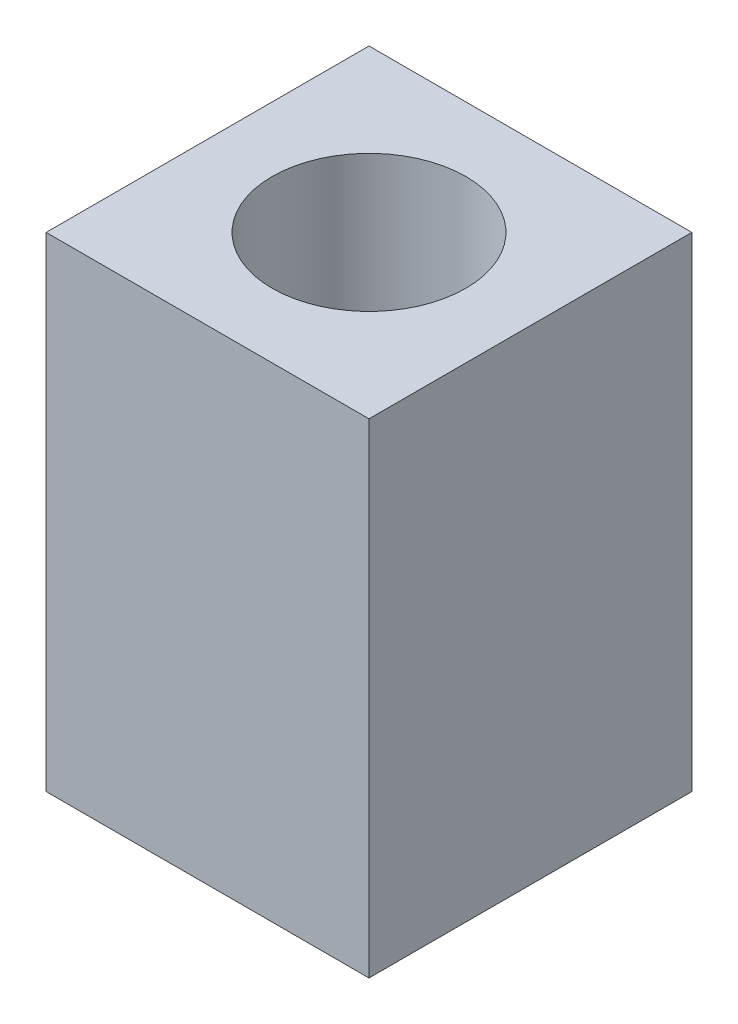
from build123d import *

# Parameters (mm, degrees)
ESQUISSE1_W             = 100
ESQUISSE1_H             = 150
EXTRUSION1_DEPTH        = 100
ESQUISSE2_R             = 30
ENL_V_MAT_EXTRU_1_DEPTH = 100
ESQUISSE3_R             = 22
ENL_V_MAT_EXTRU_2_DEPTH = 30
ENL_V_MAT_EXTRU_2_DRAFT = -5


with BuildPart() as part:
    # Esquisse1 → Extrusion1 (new body)
    with BuildSketch(Plane.XY):
        with Locations((0, 10)):
            Rectangle(ESQUISSE1_W, ESQUISSE1_H)
    extrude(amount=EXTRUSION1_DEPTH)

    # Esquisse2 → Enl_v. mat.-Extru.1 (cut)
    with BuildSketch(Plane(origin=(0, 85, 0), x_dir=(-1, 0, 0), z_dir=(0, 1, 0))):
        with Locations(Location((0, 50, 0), (0, 0, 90))):
            Circle(ESQUISSE2_R)
    extrude(amount=-ENL_V_MAT_EXTRU_1_DEPTH, mode=Mode.SUBTRACT)


with BuildPart() as enl_v_mat_extru_2_tool:
    # Esquisse3 → Enl_v. mat.-Extru.2 (with draft: the straight prism first)
    with BuildSketch(Plane(origin=(0, -15, 0), x_dir=(-1, 0, 0), z_dir=(0, 1, 0))):
        with Locations((0, 50)):
            Circle(ESQUISSE3_R)
    extrude(amount=-ENL_V_MAT_EXTRU_2_DEPTH)
    # Enl_v. mat.-Extru.2: the draft: its side faces are tilted about the plane it starts from
    enl_v_mat_extru_2_sides = [enl_v_mat_extru_2_tool.faces().sort_by_distance(p)[0] for p in [
        (22, -30, 50),
    ]]
    draft(enl_v_mat_extru_2_sides, Plane(origin=(0, -15, 0), x_dir=(-1, 0, 0), z_dir=(0, 1, 0)), ENL_V_MAT_EXTRU_2_DRAFT)


with BuildPart() as part_1:
    add(part.part)

    # Enl_v. mat.-Extru.2: cut by enl_v_mat_extru_2_tool
    add(enl_v_mat_extru_2_tool.part, mode=Mode.SUBTRACT)

    # Esquisse4 → Enl_vement de mati_re-R_volution1 (revolve, cut)
    with BuildSketch(Plane.XY.offset(50), mode=Mode.PRIVATE) as enl_vement_de_mati_re_r_volution1_sk:
        with BuildLine():
            Line((-19.240294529, -46.543577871), (-19.725294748, -41))
            Line((-19.725294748, -41), (-14.759099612, -41))
            Line((-14.759099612, -41), (-15.244099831, -46.543577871))
            ThreePointArc((-15.244099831, -46.543577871), (-15.404402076, -46.868638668), (-15.74219718, -47))
            Line((-15.74219718, -47), (-18.74219718, -47))
            ThreePointArc((-18.74219718, -47), (-19.079992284, -46.868638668), (-19.240294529, -46.543577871))
        make_face()
    revolve(enl_vement_de_mati_re_r_volution1_sk.sketch.rotate(Axis((0, 70.344827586, 50), (0, -1, 0)), 270), axis=Axis((0, 70.344827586, 50), (0, -1, 0)), mode=Mode.SUBTRACT)


solid = part_1.part
